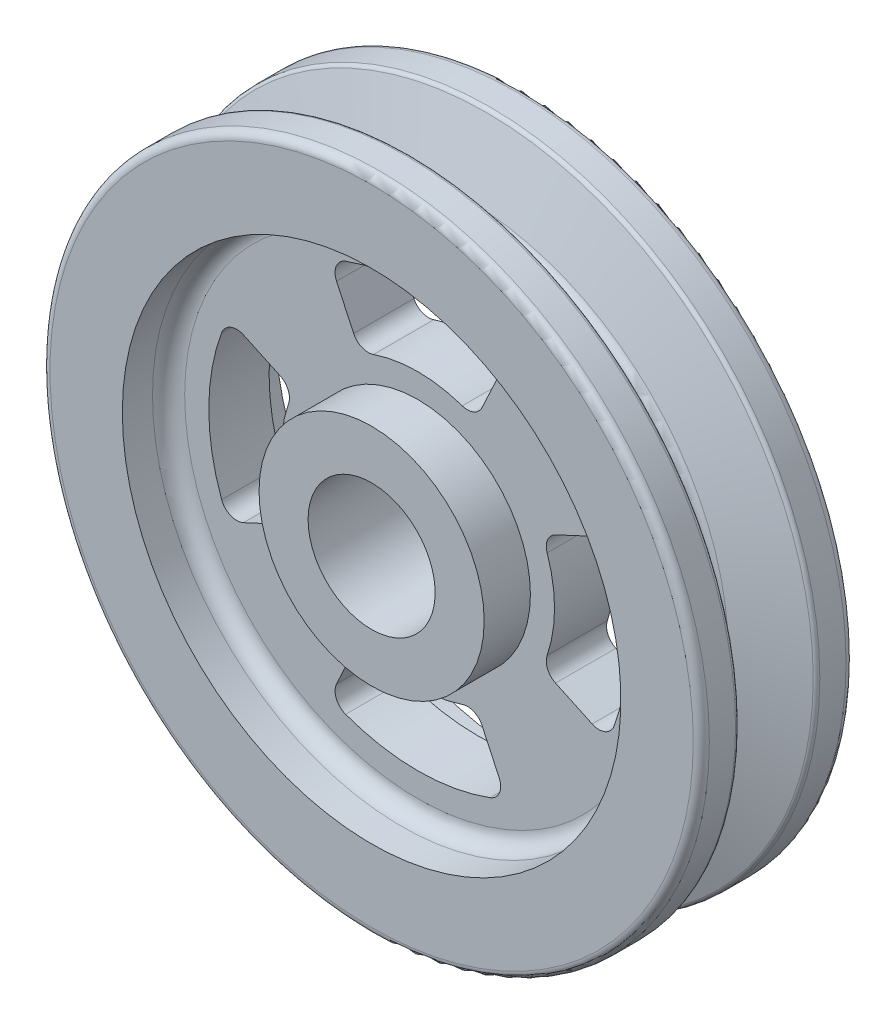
from build123d import *

# Parameters (mm, degrees)
SKETCH_3_R                       = 41
EXTRUDE_1_DEPTH                  = 9.5
SKETCH_7_R                       = 14
EXTRUDE_2_DEPTH                  = 38
SKETCH_8_R                       = 7.9
CUT_EXTRUDE_1_DEPTH              = 70.32532005
SKETCH_9_W                       = 2.5
SKETCH_9_H                       = 14
SKETCH_11_W                      = 5.75
SKETCH_11_H                      = 17
CUT_EXTRUDE_2_DEPTH              = 64.044131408
FILLET_1_R                       = 2
PATTERN_CIRCULAR_1_COUNT         = 4
FILLET_1_OF_PATTERN_CIRCULAR_1_R = 2
CHAMFER_1_SIZE                   = 1
FILLET_2_R                       = 1
FILLET_3_R                       = 0.5
FILLET_4_R                       = 2


with BuildPart() as part:
    # Sketch 3 → Extrude 1 (new, symmetric)
    with BuildSketch(Plane.XY):
        Circle(SKETCH_3_R)
    extrude(amount=EXTRUDE_1_DEPTH, both=True)

    # Sketch 6 → Cut-Revolve 1 (revolve, cut)
    with BuildSketch(Plane(origin=(0, 0, 0), x_dir=(0, 0, -1), z_dir=(1, 0, 0)), mode=Mode.PRIVATE) as cut_revolve_1_sk:
        Polygon((-4.87728318, 41), (4.87728318, 41), (1.953005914, 32), (-1.953005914, 32), align=None)
    revolve(cut_revolve_1_sk.sketch.rotate(Axis((0, 0, 9.5), (0, 0, -1)), 90), axis=Axis((0, 0, 9.5), (0, 0, -1)), mode=Mode.SUBTRACT)

    # Sketch 7 → Extrude 2 (add)
    with BuildSketch(Plane.XY.offset(9.5)):
        Circle(SKETCH_7_R)
    extrude(amount=-EXTRUDE_2_DEPTH)

    # Sketch 8 → Cut-Extrude 1 (cut, through all)
    with BuildSketch(Plane(origin=(0, 0, -28.5), x_dir=(-1, 0, 0), z_dir=(0, 0, -1))):
        Circle(SKETCH_8_R)
    extrude(amount=-CUT_EXTRUDE_1_DEPTH, mode=Mode.SUBTRACT)

    # Sketch 9 → M6x1.0 _1 (revolve, cut)
    with BuildSketch(Plane(origin=(0, 0, -21), x_dir=(0, 0, -1), z_dir=(1, 0, 0))):
        with Locations((1.25, 7)):
            Rectangle(SKETCH_9_W, SKETCH_9_H)
    revolve(axis=Axis((0, -6.35, -21), (0, 1, 0)), mode=Mode.SUBTRACT)

    # Sketch 11 → Cut-Revolve 2 (revolve, cut)
    with BuildSketch(Plane(origin=(0, 0, 0), x_dir=(0, 0, -1), z_dir=(1, 0, 0)), mode=Mode.PRIVATE) as cut_revolve_2_sk:
        with Locations((6.625, 22.5)):
            Rectangle(SKETCH_11_W, SKETCH_11_H)
    cut_revolve_2 = revolve(cut_revolve_2_sk.sketch.rotate(Axis((0, 0, -28.5), (0, 0, 1)), 270), axis=Axis((0, 0, -28.5), (0, 0, 1)), mode=Mode.SUBTRACT)

    # Mirror 1: Cut-Revolve 2 across plane
    add(cut_revolve_2.mirror(Plane.XY), mode=Mode.SUBTRACT)

    # Sketch 13 → Cut-Extrude 2 (cut, through all)
    with BuildSketch(Plane(origin=(0, 0, -3.75), x_dir=(-1, 0, 0), z_dir=(0, 0, -1))):
        with BuildLine():
            Line((15.40723238, 7.18451045), (23.564002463, 10.988074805))
            ThreePointArc((23.564002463, 10.988074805), (26, 0), (23.564002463, -10.988074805))
            Line((23.564002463, -10.988074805), (15.40723238, -7.18451045))
            ThreePointArc((15.40723238, -7.18451045), (17, 0), (15.40723238, 7.18451045))
        make_face()
    cut_extrude_2 = extrude(amount=-CUT_EXTRUDE_2_DEPTH, mode=Mode.SUBTRACT)

    # Fillet 1
    fillet_1_edges = [part.edges().sort_by_distance(p)[0] for p in [
        (-15.40723238, -7.18451045, 0),
        (-15.40723238, 7.18451045, 0),
        (-23.564002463, 10.988074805, 0),
        (-23.564002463, -10.988074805, 0),
    ]]
    fillet(fillet_1_edges, radius=FILLET_1_R)

    # Pattern Circular 1: Cut-Extrude 2 ×4 about axis
    pattern_circular_1_axis = Axis((0, 0, 0), (0, 0, 1))
    for i in range(1, PATTERN_CIRCULAR_1_COUNT):
        add(cut_extrude_2.rotate(pattern_circular_1_axis, i * 360 / PATTERN_CIRCULAR_1_COUNT), mode=Mode.SUBTRACT)

    # Fillet 1 of Pattern Circular 1
    fillet_1_of_pattern_circular_1_edges = [part.edges().sort_by_distance(p)[0] for p in [
        (7.18451045, -15.40723238, 0),
        (-7.18451045, -15.40723238, 0),
        (-10.988074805, -23.564002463, 0),
        (10.988074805, -23.564002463, 0),
        (15.40723238, 7.18451045, 0),
        (15.40723238, -7.18451045, 0),
        (23.564002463, -10.988074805, 0),
        (23.564002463, 10.988074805, 0),
        (-7.18451045, 15.40723238, 0),
        (7.18451045, 15.40723238, 0),
        (10.988074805, 23.564002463, 0),
        (-10.988074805, 23.564002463, 0),
    ]]
    fillet(fillet_1_of_pattern_circular_1_edges, radius=FILLET_1_OF_PATTERN_CIRCULAR_1_R)

    # Chamfer 1
    chamfer_1_edges = [part.edges().sort_by_distance(p)[0] for p in [
        (-14, 0, -28.5),
    ]]
    chamfer(chamfer_1_edges, length=CHAMFER_1_SIZE)

    # Fillet 2
    fillet_2_edges = [part.edges().sort_by_distance(p)[0] for p in [
        (-41, 0, -9.5),
        (-41, 0, 9.5),
        (-32, 0, -1.953005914),
        (-32, 0, 1.953005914),
    ]]
    fillet(fillet_2_edges, radius=FILLET_2_R)

    # Fillet 3
    fillet_3_edges = [part.edges().sort_by_distance(p)[0] for p in [
        (-41, 0, 4.87728318),
        (-41, 0, -4.87728318),
    ]]
    fillet(fillet_3_edges, radius=FILLET_3_R)

    # Fillet 4
    fillet_4_edges = [part.edges().sort_by_distance(p)[0] for p in [
        (-31, 0, -3.75),
        (-31, 0, 3.75),
    ]]
    fillet(fillet_4_edges, radius=FILLET_4_R)


solid = part.part
